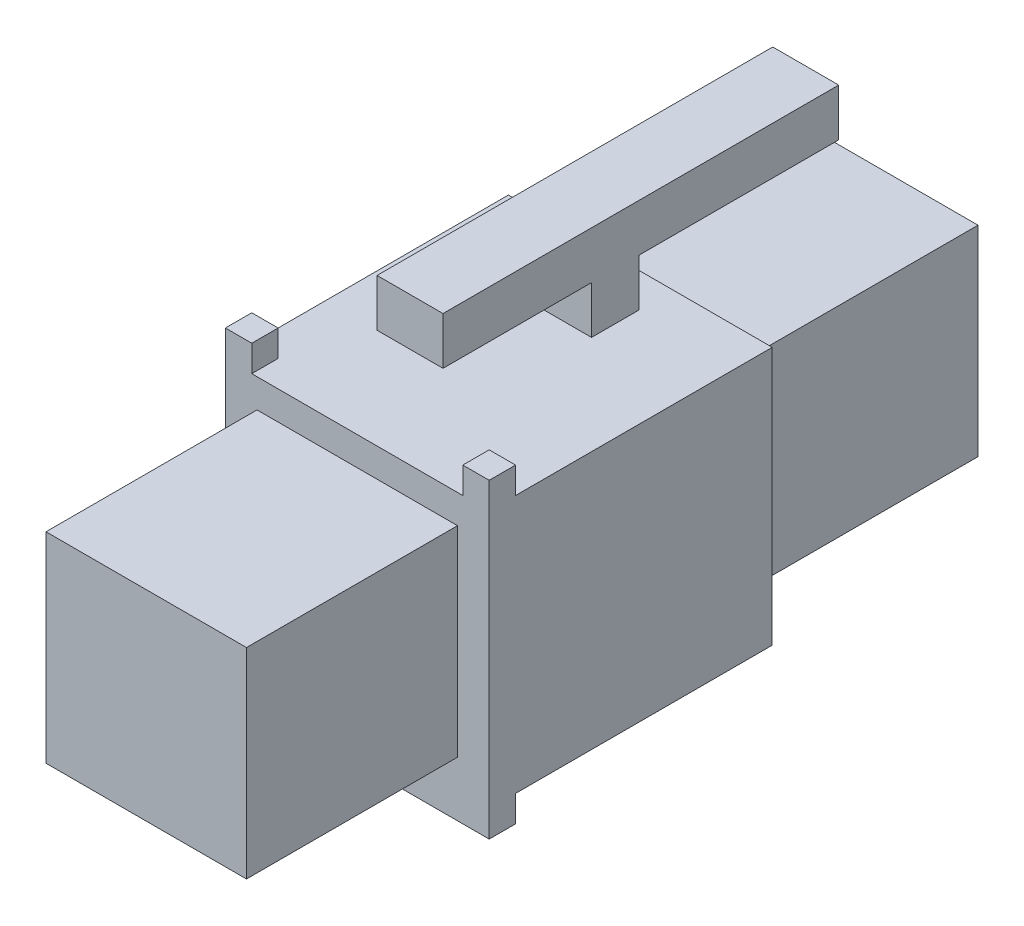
ISO-10303-21;
HEADER;
FILE_DESCRIPTION(('STEP AP214'),'2;1');
FILE_NAME('part.step','',(''),(''),'','','');
FILE_SCHEMA(('AUTOMOTIVE_DESIGN { 1 0 10303 214 1 1 1 1 }'));
ENDSEC;
DATA;
#1=APPLICATION_CONTEXT('core data for automotive mechanical design processes');
#2=APPLICATION_PROTOCOL_DEFINITION('international standard','automotive_design',2000,#1);
#3=PRODUCT_CONTEXT('',#1,'mechanical');
#4=PRODUCT('Part','Part','',(#3));
#5=PRODUCT_RELATED_PRODUCT_CATEGORY('part','',(#4));
#6=PRODUCT_DEFINITION_FORMATION('','',#4);
#7=PRODUCT_DEFINITION_CONTEXT('part definition',#1,'design');
#8=PRODUCT_DEFINITION('design','',#6,#7);
#9=PRODUCT_DEFINITION_SHAPE('','',#8);
#10=(LENGTH_UNIT() NAMED_UNIT(*) SI_UNIT(.MILLI.,.METRE.));
#11=(NAMED_UNIT(*) PLANE_ANGLE_UNIT() SI_UNIT($,.RADIAN.));
#12=(NAMED_UNIT(*) SI_UNIT($,.STERADIAN.) SOLID_ANGLE_UNIT());
#13=UNCERTAINTY_MEASURE_WITH_UNIT(LENGTH_MEASURE(1.E-05),#10,'distance_accuracy_value','');
#14=(GEOMETRIC_REPRESENTATION_CONTEXT(3) GLOBAL_UNCERTAINTY_ASSIGNED_CONTEXT((#13)) GLOBAL_UNIT_ASSIGNED_CONTEXT((#10,
#11,#12)) REPRESENTATION_CONTEXT('',''));
#15=CARTESIAN_POINT('',(0.,0.,0.));
#16=DIRECTION('',(0.,0.,1.));
#17=DIRECTION('',(1.,0.,0.));
#18=AXIS2_PLACEMENT_3D('',#15,#16,#17);
#19=CARTESIAN_POINT('',(5.,4.89,10.73));
#20=DIRECTION('',(0.,0.,-1.));
#21=DIRECTION('',(0.,1.,0.));
#22=AXIS2_PLACEMENT_3D('',#19,#20,#21);
#23=PLANE('',#22);
#24=DIRECTION('',(0.,-1.,0.));
#25=VECTOR('',#24,1.);
#26=CARTESIAN_POINT('',(-4.,8.49,10.73));
#27=LINE('',#26,#25);
#28=CARTESIAN_POINT('',(-4.,5.89,10.73));
#29=VERTEX_POINT('',#28);
#30=CARTESIAN_POINT('',(-4.,4.89,10.73));
#31=VERTEX_POINT('',#30);
#32=EDGE_CURVE('E253',#29,#31,#27,.T.);
#33=ORIENTED_EDGE('',*,*,#32,.F.);
#34=DIRECTION('',(1.,0.,0.));
#35=VECTOR('',#34,1.);
#36=CARTESIAN_POINT('',(-6.4142135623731,5.89,10.73));
#37=LINE('',#36,#35);
#38=CARTESIAN_POINT('',(-5.,5.89,10.73));
#39=VERTEX_POINT('',#38);
#40=EDGE_CURVE('E402',#39,#29,#37,.T.);
#41=ORIENTED_EDGE('',*,*,#40,.F.);
#42=DIRECTION('',(0.,-1.,0.));
#43=VECTOR('',#42,1.);
#44=CARTESIAN_POINT('',(-5.,4.89,10.73));
#45=LINE('',#44,#43);
#46=CARTESIAN_POINT('',(-5.,-5.89,10.73));
#47=VERTEX_POINT('',#46);
#48=EDGE_CURVE('E406',#39,#47,#45,.T.);
#49=ORIENTED_EDGE('',*,*,#48,.T.);
#50=DIRECTION('',(1.,0.,0.));
#51=VECTOR('',#50,1.);
#52=CARTESIAN_POINT('',(-6.4142135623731,-5.89,10.73));
#53=LINE('',#52,#51);
#54=CARTESIAN_POINT('',(5.,-5.89,10.73));
#55=VERTEX_POINT('',#54);
#56=EDGE_CURVE('E373',#47,#55,#53,.T.);
#57=ORIENTED_EDGE('',*,*,#56,.T.);
#58=DIRECTION('',(0.,-1.,0.));
#59=VECTOR('',#58,1.);
#60=CARTESIAN_POINT('',(5.,4.89,10.73));
#61=LINE('',#60,#59);
#62=CARTESIAN_POINT('',(5.,5.89,10.73));
#63=VERTEX_POINT('',#62);
#64=EDGE_CURVE('E427',#63,#55,#61,.T.);
#65=ORIENTED_EDGE('',*,*,#64,.F.);
#66=CARTESIAN_POINT('',(4.,5.89,10.73));
#67=VERTEX_POINT('',#66);
#68=EDGE_CURVE('E463',#67,#63,#37,.T.);
#69=ORIENTED_EDGE('',*,*,#68,.F.);
#70=DIRECTION('',(0.,-1.,0.));
#71=VECTOR('',#70,1.);
#72=CARTESIAN_POINT('',(4.,8.49,10.73));
#73=LINE('',#72,#71);
#74=CARTESIAN_POINT('',(4.,4.89,10.73));
#75=VERTEX_POINT('',#74);
#76=EDGE_CURVE('E250',#67,#75,#73,.T.);
#77=ORIENTED_EDGE('',*,*,#76,.T.);
#78=DIRECTION('',(1.,0.,0.));
#79=VECTOR('',#78,1.);
#80=CARTESIAN_POINT('',(-4.,4.89,10.73));
#81=LINE('',#80,#79);
#82=EDGE_CURVE('E241',#31,#75,#81,.T.);
#83=ORIENTED_EDGE('',*,*,#82,.F.);
#84=EDGE_LOOP('',(#33,#41,#49,#57,#65,#69,#77,#83));
#85=FACE_BOUND('',#84,.T.);
#86=DIRECTION('',(0.,-1.,0.));
#87=VECTOR('',#86,1.);
#88=CARTESIAN_POINT('',(-3.8,3.8,10.73));
#89=LINE('',#88,#87);
#90=CARTESIAN_POINT('',(-3.8,3.8,10.73));
#91=VERTEX_POINT('',#90);
#92=CARTESIAN_POINT('',(-3.8,-3.8,10.73));
#93=VERTEX_POINT('',#92);
#94=EDGE_CURVE('E237',#91,#93,#89,.T.);
#95=ORIENTED_EDGE('',*,*,#94,.F.);
#96=DIRECTION('',(-1.,0.,0.));
#97=VECTOR('',#96,1.);
#98=CARTESIAN_POINT('',(3.8,3.8,10.73));
#99=LINE('',#98,#97);
#100=CARTESIAN_POINT('',(3.8,3.8,10.73));
#101=VERTEX_POINT('',#100);
#102=EDGE_CURVE('E234',#101,#91,#99,.T.);
#103=ORIENTED_EDGE('',*,*,#102,.F.);
#104=DIRECTION('',(0.,1.,0.));
#105=VECTOR('',#104,1.);
#106=CARTESIAN_POINT('',(3.8,-3.8,10.73));
#107=LINE('',#106,#105);
#108=CARTESIAN_POINT('',(3.8,-3.8,10.73));
#109=VERTEX_POINT('',#108);
#110=EDGE_CURVE('E52',#109,#101,#107,.T.);
#111=ORIENTED_EDGE('',*,*,#110,.F.);
#112=DIRECTION('',(1.,0.,0.));
#113=VECTOR('',#112,1.);
#114=CARTESIAN_POINT('',(-3.8,-3.8,10.73));
#115=LINE('',#114,#113);
#116=EDGE_CURVE('E47',#93,#109,#115,.T.);
#117=ORIENTED_EDGE('',*,*,#116,.F.);
#118=EDGE_LOOP('',(#95,#103,#111,#117));
#119=FACE_BOUND('',#118,.T.);
#120=ADVANCED_FACE('F32',(#85,#119),#23,.F.);
#121=CARTESIAN_POINT('',(-6.4142135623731,5.89,10.73));
#122=DIRECTION('',(0.,1.,0.));
#123=DIRECTION('',(0.,0.,1.));
#124=AXIS2_PLACEMENT_3D('',#121,#122,#123);
#125=PLANE('',#124);
#126=ORIENTED_EDGE('',*,*,#40,.T.);
#127=DIRECTION('',(0.,0.,-1.));
#128=VECTOR('',#127,1.);
#129=CARTESIAN_POINT('',(-4.,5.89,10.73));
#130=LINE('',#129,#128);
#131=CARTESIAN_POINT('',(-4.,5.89,9.73));
#132=VERTEX_POINT('',#131);
#133=EDGE_CURVE('E258',#29,#132,#130,.T.);
#134=ORIENTED_EDGE('',*,*,#133,.T.);
#135=DIRECTION('',(1.,0.,0.));
#136=VECTOR('',#135,1.);
#137=CARTESIAN_POINT('',(-6.4142135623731,5.89,9.73));
#138=LINE('',#137,#136);
#139=CARTESIAN_POINT('',(-5.,5.89,9.73));
#140=VERTEX_POINT('',#139);
#141=EDGE_CURVE('E387',#140,#132,#138,.T.);
#142=ORIENTED_EDGE('',*,*,#141,.F.);
#143=DIRECTION('',(0.,0.,-1.));
#144=VECTOR('',#143,1.);
#145=CARTESIAN_POINT('',(-5.,5.89,10.73));
#146=LINE('',#145,#144);
#147=EDGE_CURVE('E401',#39,#140,#146,.T.);
#148=ORIENTED_EDGE('',*,*,#147,.F.);
#149=EDGE_LOOP('',(#126,#134,#142,#148));
#150=FACE_BOUND('',#149,.T.);
#151=ADVANCED_FACE('F475',(#150),#125,.T.);
#152=CARTESIAN_POINT('',(4.,5.89,9.73));
#153=VERTEX_POINT('',#152);
#154=CARTESIAN_POINT('',(5.,5.89,9.73));
#155=VERTEX_POINT('',#154);
#156=EDGE_CURVE('E396',#153,#155,#138,.T.);
#157=ORIENTED_EDGE('',*,*,#156,.F.);
#158=DIRECTION('',(0.,0.,1.));
#159=VECTOR('',#158,1.);
#160=CARTESIAN_POINT('',(4.,5.89,10.73));
#161=LINE('',#160,#159);
#162=EDGE_CURVE('E255',#153,#67,#161,.T.);
#163=ORIENTED_EDGE('',*,*,#162,.T.);
#164=ORIENTED_EDGE('',*,*,#68,.T.);
#165=DIRECTION('',(0.,0.,1.));
#166=VECTOR('',#165,1.);
#167=CARTESIAN_POINT('',(5.,5.89,10.73));
#168=LINE('',#167,#166);
#169=EDGE_CURVE('E383',#155,#63,#168,.T.);
#170=ORIENTED_EDGE('',*,*,#169,.F.);
#171=EDGE_LOOP('',(#157,#163,#164,#170));
#172=FACE_BOUND('',#171,.T.);
#173=ADVANCED_FACE('F483',(#172),#125,.T.);
#174=CARTESIAN_POINT('',(-6.4142135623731,4.89,9.73));
#175=DIRECTION('',(0.,0.,-1.));
#176=DIRECTION('',(-1.,0.,0.));
#177=AXIS2_PLACEMENT_3D('',#174,#175,#176);
#178=PLANE('',#177);
#179=ORIENTED_EDGE('',*,*,#141,.T.);
#180=DIRECTION('',(0.,-1.,0.));
#181=VECTOR('',#180,1.);
#182=CARTESIAN_POINT('',(-4.,4.89,9.73));
#183=LINE('',#182,#181);
#184=CARTESIAN_POINT('',(-4.,4.89,9.73));
#185=VERTEX_POINT('',#184);
#186=EDGE_CURVE('E11',#132,#185,#183,.T.);
#187=ORIENTED_EDGE('',*,*,#186,.T.);
#188=DIRECTION('',(1.,0.,0.));
#189=VECTOR('',#188,1.);
#190=CARTESIAN_POINT('',(-6.4142135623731,4.89,9.73));
#191=LINE('',#190,#189);
#192=CARTESIAN_POINT('',(-5.,4.89,9.73));
#193=VERTEX_POINT('',#192);
#194=EDGE_CURVE('E382',#193,#185,#191,.T.);
#195=ORIENTED_EDGE('',*,*,#194,.F.);
#196=DIRECTION('',(0.,-1.,0.));
#197=VECTOR('',#196,1.);
#198=CARTESIAN_POINT('',(-5.,4.89,9.73));
#199=LINE('',#198,#197);
#200=EDGE_CURVE('E399',#140,#193,#199,.T.);
#201=ORIENTED_EDGE('',*,*,#200,.F.);
#202=EDGE_LOOP('',(#179,#187,#195,#201));
#203=FACE_BOUND('',#202,.T.);
#204=ADVANCED_FACE('F473',(#203),#178,.T.);
#205=CARTESIAN_POINT('',(4.,4.89,9.73));
#206=VERTEX_POINT('',#205);
#207=CARTESIAN_POINT('',(5.,4.89,9.73));
#208=VERTEX_POINT('',#207);
#209=EDGE_CURVE('E380',#206,#208,#191,.T.);
#210=ORIENTED_EDGE('',*,*,#209,.F.);
#211=DIRECTION('',(0.,1.,0.));
#212=VECTOR('',#211,1.);
#213=CARTESIAN_POINT('',(4.,4.89,9.73));
#214=LINE('',#213,#212);
#215=EDGE_CURVE('E40',#206,#153,#214,.T.);
#216=ORIENTED_EDGE('',*,*,#215,.T.);
#217=ORIENTED_EDGE('',*,*,#156,.T.);
#218=DIRECTION('',(0.,1.,0.));
#219=VECTOR('',#218,1.);
#220=CARTESIAN_POINT('',(5.,4.89,9.73));
#221=LINE('',#220,#219);
#222=EDGE_CURVE('E451',#208,#155,#221,.T.);
#223=ORIENTED_EDGE('',*,*,#222,.F.);
#224=EDGE_LOOP('',(#210,#216,#217,#223));
#225=FACE_BOUND('',#224,.T.);
#226=ADVANCED_FACE('F452',(#225),#178,.T.);
#227=CARTESIAN_POINT('',(5.,4.89,0.));
#228=DIRECTION('',(0.,0.,1.));
#229=DIRECTION('',(1.,0.,0.));
#230=AXIS2_PLACEMENT_3D('',#227,#228,#229);
#231=PLANE('',#230);
#232=DIRECTION('',(0.,1.,0.));
#233=VECTOR('',#232,1.);
#234=CARTESIAN_POINT('',(-5.,4.89,0.));
#235=LINE('',#234,#233);
#236=CARTESIAN_POINT('',(-5.,-4.89,0.));
#237=VERTEX_POINT('',#236);
#238=CARTESIAN_POINT('',(-5.,4.89,0.));
#239=VERTEX_POINT('',#238);
#240=EDGE_CURVE('E420',#237,#239,#235,.T.);
#241=ORIENTED_EDGE('',*,*,#240,.T.);
#242=DIRECTION('',(-1.,0.,0.));
#243=VECTOR('',#242,1.);
#244=CARTESIAN_POINT('',(5.,4.89,0.));
#245=LINE('',#244,#243);
#246=CARTESIAN_POINT('',(5.,4.89,0.));
#247=VERTEX_POINT('',#246);
#248=EDGE_CURVE('E414',#247,#239,#245,.T.);
#249=ORIENTED_EDGE('',*,*,#248,.F.);
#250=DIRECTION('',(0.,1.,0.));
#251=VECTOR('',#250,1.);
#252=CARTESIAN_POINT('',(5.,4.89,0.));
#253=LINE('',#252,#251);
#254=CARTESIAN_POINT('',(5.,-4.89,0.));
#255=VERTEX_POINT('',#254);
#256=EDGE_CURVE('E389',#255,#247,#253,.T.);
#257=ORIENTED_EDGE('',*,*,#256,.F.);
#258=DIRECTION('',(-1.,0.,0.));
#259=VECTOR('',#258,1.);
#260=CARTESIAN_POINT('',(5.,-4.89,0.));
#261=LINE('',#260,#259);
#262=EDGE_CURVE('E411',#255,#237,#261,.T.);
#263=ORIENTED_EDGE('',*,*,#262,.T.);
#264=EDGE_LOOP('',(#241,#249,#257,#263));
#265=FACE_BOUND('',#264,.T.);
#266=DIRECTION('',(1.,0.,0.));
#267=VECTOR('',#266,1.);
#268=CARTESIAN_POINT('',(-3.8,3.8,0.));
#269=LINE('',#268,#267);
#270=CARTESIAN_POINT('',(-3.8,3.8,0.));
#271=VERTEX_POINT('',#270);
#272=CARTESIAN_POINT('',(3.8,3.8,0.));
#273=VERTEX_POINT('',#272);
#274=EDGE_CURVE('E321',#271,#273,#269,.T.);
#275=ORIENTED_EDGE('',*,*,#274,.F.);
#276=DIRECTION('',(0.,1.,0.));
#277=VECTOR('',#276,1.);
#278=CARTESIAN_POINT('',(-3.8,3.8,0.));
#279=LINE('',#278,#277);
#280=CARTESIAN_POINT('',(-3.8,-3.8,0.));
#281=VERTEX_POINT('',#280);
#282=EDGE_CURVE('E326',#281,#271,#279,.T.);
#283=ORIENTED_EDGE('',*,*,#282,.F.);
#284=DIRECTION('',(-1.,0.,0.));
#285=VECTOR('',#284,1.);
#286=CARTESIAN_POINT('',(-3.8,-3.8,0.));
#287=LINE('',#286,#285);
#288=CARTESIAN_POINT('',(3.8,-3.8,0.));
#289=VERTEX_POINT('',#288);
#290=EDGE_CURVE('E338',#289,#281,#287,.T.);
#291=ORIENTED_EDGE('',*,*,#290,.F.);
#292=DIRECTION('',(0.,-1.,0.));
#293=VECTOR('',#292,1.);
#294=CARTESIAN_POINT('',(3.8,3.8,0.));
#295=LINE('',#294,#293);
#296=EDGE_CURVE('E335',#273,#289,#295,.T.);
#297=ORIENTED_EDGE('',*,*,#296,.F.);
#298=EDGE_LOOP('',(#275,#283,#291,#297));
#299=FACE_BOUND('',#298,.T.);
#300=ADVANCED_FACE('F34',(#265,#299),#231,.F.);
#301=CARTESIAN_POINT('',(5.,-4.89,10.73));
#302=DIRECTION('',(0.,1.,0.));
#303=DIRECTION('',(0.,0.,1.));
#304=AXIS2_PLACEMENT_3D('',#301,#302,#303);
#305=PLANE('',#304);
#306=DIRECTION('',(1.,0.,0.));
#307=VECTOR('',#306,1.);
#308=CARTESIAN_POINT('',(-6.4142135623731,-4.89,9.73));
#309=LINE('',#308,#307);
#310=CARTESIAN_POINT('',(-5.,-4.89,9.73));
#311=VERTEX_POINT('',#310);
#312=CARTESIAN_POINT('',(5.,-4.89,9.73));
#313=VERTEX_POINT('',#312);
#314=EDGE_CURVE('E363',#311,#313,#309,.T.);
#315=ORIENTED_EDGE('',*,*,#314,.F.);
#316=DIRECTION('',(0.,0.,-1.));
#317=VECTOR('',#316,1.);
#318=CARTESIAN_POINT('',(-5.,-4.89,10.73));
#319=LINE('',#318,#317);
#320=EDGE_CURVE('E404',#311,#237,#319,.T.);
#321=ORIENTED_EDGE('',*,*,#320,.T.);
#322=ORIENTED_EDGE('',*,*,#262,.F.);
#323=DIRECTION('',(0.,0.,-1.));
#324=VECTOR('',#323,1.);
#325=CARTESIAN_POINT('',(5.,-4.89,10.73));
#326=LINE('',#325,#324);
#327=EDGE_CURVE('E368',#313,#255,#326,.T.);
#328=ORIENTED_EDGE('',*,*,#327,.F.);
#329=EDGE_LOOP('',(#315,#321,#322,#328));
#330=FACE_BOUND('',#329,.T.);
#331=ADVANCED_FACE('F494',(#330),#305,.F.);
#332=CARTESIAN_POINT('',(5.,4.89,10.73));
#333=DIRECTION('',(0.,-1.,0.));
#334=DIRECTION('',(0.,0.,-1.));
#335=AXIS2_PLACEMENT_3D('',#332,#333,#334);
#336=PLANE('',#335);
#337=DIRECTION('',(-1.,0.,0.));
#338=VECTOR('',#337,1.);
#339=CARTESIAN_POINT('',(1.25,4.89,1.3));
#340=LINE('',#339,#338);
#341=CARTESIAN_POINT('',(1.25,4.89,1.3));
#342=VERTEX_POINT('',#341);
#343=CARTESIAN_POINT('',(-1.25,4.89,1.3));
#344=VERTEX_POINT('',#343);
#345=EDGE_CURVE('E310',#342,#344,#340,.T.);
#346=ORIENTED_EDGE('',*,*,#345,.F.);
#347=DIRECTION('',(0.,0.,-1.));
#348=VECTOR('',#347,1.);
#349=CARTESIAN_POINT('',(1.25,4.89,3.1));
#350=LINE('',#349,#348);
#351=CARTESIAN_POINT('',(1.25,4.89,3.1));
#352=VERTEX_POINT('',#351);
#353=EDGE_CURVE('E271',#352,#342,#350,.T.);
#354=ORIENTED_EDGE('',*,*,#353,.F.);
#355=DIRECTION('',(-1.,0.,0.));
#356=VECTOR('',#355,1.);
#357=CARTESIAN_POINT('',(1.25,4.89,3.1));
#358=LINE('',#357,#356);
#359=CARTESIAN_POINT('',(-1.25,4.89,3.1));
#360=VERTEX_POINT('',#359);
#361=EDGE_CURVE('E313',#352,#360,#358,.T.);
#362=ORIENTED_EDGE('',*,*,#361,.T.);
#363=DIRECTION('',(0.,0.,-1.));
#364=VECTOR('',#363,1.);
#365=CARTESIAN_POINT('',(-1.25,4.89,3.1));
#366=LINE('',#365,#364);
#367=EDGE_CURVE('E290',#360,#344,#366,.T.);
#368=ORIENTED_EDGE('',*,*,#367,.T.);
#369=EDGE_LOOP('',(#346,#354,#362,#368));
#370=FACE_BOUND('',#369,.T.);
#371=DIRECTION('',(0.,0.,1.));
#372=VECTOR('',#371,1.);
#373=CARTESIAN_POINT('',(-5.,4.89,10.73));
#374=LINE('',#373,#372);
#375=EDGE_CURVE('E417',#239,#193,#374,.T.);
#376=ORIENTED_EDGE('',*,*,#375,.T.);
#377=ORIENTED_EDGE('',*,*,#194,.T.);
#378=DIRECTION('',(0.,0.,1.));
#379=VECTOR('',#378,1.);
#380=CARTESIAN_POINT('',(-4.,4.89,9.73));
#381=LINE('',#380,#379);
#382=EDGE_CURVE('E238',#185,#31,#381,.T.);
#383=ORIENTED_EDGE('',*,*,#382,.T.);
#384=ORIENTED_EDGE('',*,*,#82,.T.);
#385=DIRECTION('',(0.,0.,-1.));
#386=VECTOR('',#385,1.);
#387=CARTESIAN_POINT('',(4.,4.89,9.73));
#388=LINE('',#387,#386);
#389=EDGE_CURVE('E248',#75,#206,#388,.T.);
#390=ORIENTED_EDGE('',*,*,#389,.T.);
#391=ORIENTED_EDGE('',*,*,#209,.T.);
#392=DIRECTION('',(0.,0.,1.));
#393=VECTOR('',#392,1.);
#394=CARTESIAN_POINT('',(5.,4.89,10.73));
#395=LINE('',#394,#393);
#396=EDGE_CURVE('E421',#247,#208,#395,.T.);
#397=ORIENTED_EDGE('',*,*,#396,.F.);
#398=ORIENTED_EDGE('',*,*,#248,.T.);
#399=EDGE_LOOP('',(#376,#377,#383,#384,#390,#391,#397,#398));
#400=FACE_BOUND('',#399,.T.);
#401=ADVANCED_FACE('F444',(#370,#400),#336,.F.);
#402=CARTESIAN_POINT('',(5.,-4.89,0.));
#403=DIRECTION('',(1.,0.,0.));
#404=DIRECTION('',(0.,0.,-1.));
#405=AXIS2_PLACEMENT_3D('',#402,#403,#404);
#406=PLANE('',#405);
#407=ORIENTED_EDGE('',*,*,#256,.T.);
#408=ORIENTED_EDGE('',*,*,#396,.T.);
#409=ORIENTED_EDGE('',*,*,#222,.T.);
#410=ORIENTED_EDGE('',*,*,#169,.T.);
#411=ORIENTED_EDGE('',*,*,#64,.T.);
#412=DIRECTION('',(0.,0.,-1.));
#413=VECTOR('',#412,1.);
#414=CARTESIAN_POINT('',(5.,-5.89,10.73));
#415=LINE('',#414,#413);
#416=CARTESIAN_POINT('',(5.,-5.89,9.73));
#417=VERTEX_POINT('',#416);
#418=EDGE_CURVE('E354',#55,#417,#415,.T.);
#419=ORIENTED_EDGE('',*,*,#418,.T.);
#420=DIRECTION('',(0.,1.,0.));
#421=VECTOR('',#420,1.);
#422=CARTESIAN_POINT('',(5.,-4.89,9.73));
#423=LINE('',#422,#421);
#424=EDGE_CURVE('E357',#417,#313,#423,.T.);
#425=ORIENTED_EDGE('',*,*,#424,.T.);
#426=ORIENTED_EDGE('',*,*,#327,.T.);
#427=EDGE_LOOP('',(#407,#408,#409,#410,#411,#419,#425,#426));
#428=FACE_BOUND('',#427,.T.);
#429=ADVANCED_FACE('F438',(#428),#406,.T.);
#430=CARTESIAN_POINT('',(-5.,-4.89,0.));
#431=DIRECTION('',(1.,0.,0.));
#432=DIRECTION('',(0.,0.,-1.));
#433=AXIS2_PLACEMENT_3D('',#430,#431,#432);
#434=PLANE('',#433);
#435=ORIENTED_EDGE('',*,*,#240,.F.);
#436=ORIENTED_EDGE('',*,*,#320,.F.);
#437=DIRECTION('',(0.,-1.,0.));
#438=VECTOR('',#437,1.);
#439=CARTESIAN_POINT('',(-5.,-4.89,9.73));
#440=LINE('',#439,#438);
#441=CARTESIAN_POINT('',(-5.,-5.89,9.73));
#442=VERTEX_POINT('',#441);
#443=EDGE_CURVE('E367',#311,#442,#440,.T.);
#444=ORIENTED_EDGE('',*,*,#443,.T.);
#445=DIRECTION('',(0.,0.,1.));
#446=VECTOR('',#445,1.);
#447=CARTESIAN_POINT('',(-5.,-5.89,10.73));
#448=LINE('',#447,#446);
#449=EDGE_CURVE('E377',#442,#47,#448,.T.);
#450=ORIENTED_EDGE('',*,*,#449,.T.);
#451=ORIENTED_EDGE('',*,*,#48,.F.);
#452=ORIENTED_EDGE('',*,*,#147,.T.);
#453=ORIENTED_EDGE('',*,*,#200,.T.);
#454=ORIENTED_EDGE('',*,*,#375,.F.);
#455=EDGE_LOOP('',(#435,#436,#444,#450,#451,#452,#453,#454));
#456=FACE_BOUND('',#455,.T.);
#457=ADVANCED_FACE('F495',(#456),#434,.F.);
#458=CARTESIAN_POINT('',(-6.4142135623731,-4.89,9.73));
#459=DIRECTION('',(0.,0.,-1.));
#460=DIRECTION('',(0.,1.,0.));
#461=AXIS2_PLACEMENT_3D('',#458,#459,#460);
#462=PLANE('',#461);
#463=ORIENTED_EDGE('',*,*,#443,.F.);
#464=ORIENTED_EDGE('',*,*,#314,.T.);
#465=ORIENTED_EDGE('',*,*,#424,.F.);
#466=DIRECTION('',(1.,0.,0.));
#467=VECTOR('',#466,1.);
#468=CARTESIAN_POINT('',(-6.4142135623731,-5.89,9.73));
#469=LINE('',#468,#467);
#470=EDGE_CURVE('E360',#442,#417,#469,.T.);
#471=ORIENTED_EDGE('',*,*,#470,.F.);
#472=EDGE_LOOP('',(#463,#464,#465,#471));
#473=FACE_BOUND('',#472,.T.);
#474=ADVANCED_FACE('F491',(#473),#462,.T.);
#475=CARTESIAN_POINT('',(-6.4142135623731,-5.89,10.73));
#476=DIRECTION('',(0.,-1.,0.));
#477=DIRECTION('',(0.,0.,-1.));
#478=AXIS2_PLACEMENT_3D('',#475,#476,#477);
#479=PLANE('',#478);
#480=ORIENTED_EDGE('',*,*,#449,.F.);
#481=ORIENTED_EDGE('',*,*,#470,.T.);
#482=ORIENTED_EDGE('',*,*,#418,.F.);
#483=ORIENTED_EDGE('',*,*,#56,.F.);
#484=EDGE_LOOP('',(#480,#481,#482,#483));
#485=FACE_BOUND('',#484,.T.);
#486=ADVANCED_FACE('F486',(#485),#479,.T.);
#487=CARTESIAN_POINT('',(-3.8,3.8,-9.));
#488=DIRECTION('',(0.,-1.,0.));
#489=DIRECTION('',(1.,0.,0.));
#490=AXIS2_PLACEMENT_3D('',#487,#488,#489);
#491=PLANE('',#490);
#492=ORIENTED_EDGE('',*,*,#274,.T.);
#493=DIRECTION('',(0.,0.,1.));
#494=VECTOR('',#493,1.);
#495=CARTESIAN_POINT('',(3.8,3.8,-9.));
#496=LINE('',#495,#494);
#497=CARTESIAN_POINT('',(3.8,3.8,-9.));
#498=VERTEX_POINT('',#497);
#499=EDGE_CURVE('E351',#498,#273,#496,.T.);
#500=ORIENTED_EDGE('',*,*,#499,.F.);
#501=DIRECTION('',(1.,0.,0.));
#502=VECTOR('',#501,1.);
#503=CARTESIAN_POINT('',(-3.8,3.8,-9.));
#504=LINE('',#503,#502);
#505=CARTESIAN_POINT('',(-3.8,3.8,-9.));
#506=VERTEX_POINT('',#505);
#507=EDGE_CURVE('E322',#506,#498,#504,.T.);
#508=ORIENTED_EDGE('',*,*,#507,.F.);
#509=DIRECTION('',(0.,0.,1.));
#510=VECTOR('',#509,1.);
#511=CARTESIAN_POINT('',(-3.8,3.8,-9.));
#512=LINE('',#511,#510);
#513=EDGE_CURVE('E332',#506,#271,#512,.T.);
#514=ORIENTED_EDGE('',*,*,#513,.T.);
#515=EDGE_LOOP('',(#492,#500,#508,#514));
#516=FACE_BOUND('',#515,.T.);
#517=ADVANCED_FACE('F592',(#516),#491,.F.);
#518=CARTESIAN_POINT('',(3.8,3.8,-9.));
#519=DIRECTION('',(-1.,0.,0.));
#520=DIRECTION('',(0.,-1.,0.));
#521=AXIS2_PLACEMENT_3D('',#518,#519,#520);
#522=PLANE('',#521);
#523=ORIENTED_EDGE('',*,*,#296,.T.);
#524=DIRECTION('',(0.,0.,1.));
#525=VECTOR('',#524,1.);
#526=CARTESIAN_POINT('',(3.8,-3.8,-9.));
#527=LINE('',#526,#525);
#528=CARTESIAN_POINT('',(3.8,-3.8,-9.));
#529=VERTEX_POINT('',#528);
#530=EDGE_CURVE('E348',#529,#289,#527,.T.);
#531=ORIENTED_EDGE('',*,*,#530,.F.);
#532=DIRECTION('',(0.,-1.,0.));
#533=VECTOR('',#532,1.);
#534=CARTESIAN_POINT('',(3.8,3.8,-9.));
#535=LINE('',#534,#533);
#536=EDGE_CURVE('E325',#498,#529,#535,.T.);
#537=ORIENTED_EDGE('',*,*,#536,.F.);
#538=ORIENTED_EDGE('',*,*,#499,.T.);
#539=EDGE_LOOP('',(#523,#531,#537,#538));
#540=FACE_BOUND('',#539,.T.);
#541=ADVANCED_FACE('F588',(#540),#522,.F.);
#542=CARTESIAN_POINT('',(-3.8,-3.8,-9.));
#543=DIRECTION('',(0.,1.,0.));
#544=DIRECTION('',(-1.,0.,0.));
#545=AXIS2_PLACEMENT_3D('',#542,#543,#544);
#546=PLANE('',#545);
#547=ORIENTED_EDGE('',*,*,#290,.T.);
#548=DIRECTION('',(0.,0.,1.));
#549=VECTOR('',#548,1.);
#550=CARTESIAN_POINT('',(-3.8,-3.8,-9.));
#551=LINE('',#550,#549);
#552=CARTESIAN_POINT('',(-3.8,-3.8,-9.));
#553=VERTEX_POINT('',#552);
#554=EDGE_CURVE('E345',#553,#281,#551,.T.);
#555=ORIENTED_EDGE('',*,*,#554,.F.);
#556=DIRECTION('',(-1.,0.,0.));
#557=VECTOR('',#556,1.);
#558=CARTESIAN_POINT('',(-3.8,-3.8,-9.));
#559=LINE('',#558,#557);
#560=EDGE_CURVE('E328',#529,#553,#559,.T.);
#561=ORIENTED_EDGE('',*,*,#560,.F.);
#562=ORIENTED_EDGE('',*,*,#530,.T.);
#563=EDGE_LOOP('',(#547,#555,#561,#562));
#564=FACE_BOUND('',#563,.T.);
#565=ADVANCED_FACE('F584',(#564),#546,.F.);
#566=CARTESIAN_POINT('',(-3.8,3.8,-9.));
#567=DIRECTION('',(1.,0.,0.));
#568=DIRECTION('',(0.,1.,0.));
#569=AXIS2_PLACEMENT_3D('',#566,#567,#568);
#570=PLANE('',#569);
#571=ORIENTED_EDGE('',*,*,#282,.T.);
#572=ORIENTED_EDGE('',*,*,#513,.F.);
#573=DIRECTION('',(0.,1.,0.));
#574=VECTOR('',#573,1.);
#575=CARTESIAN_POINT('',(-3.8,3.8,-9.));
#576=LINE('',#575,#574);
#577=EDGE_CURVE('E330',#553,#506,#576,.T.);
#578=ORIENTED_EDGE('',*,*,#577,.F.);
#579=ORIENTED_EDGE('',*,*,#554,.T.);
#580=EDGE_LOOP('',(#571,#572,#578,#579));
#581=FACE_BOUND('',#580,.T.);
#582=ADVANCED_FACE('F580',(#581),#570,.F.);
#583=CARTESIAN_POINT('',(3.8,3.8,-9.));
#584=DIRECTION('',(0.,0.,-1.));
#585=DIRECTION('',(-1.,0.,0.));
#586=AXIS2_PLACEMENT_3D('',#583,#584,#585);
#587=PLANE('',#586);
#588=ORIENTED_EDGE('',*,*,#507,.T.);
#589=ORIENTED_EDGE('',*,*,#536,.T.);
#590=ORIENTED_EDGE('',*,*,#560,.T.);
#591=ORIENTED_EDGE('',*,*,#577,.T.);
#592=EDGE_LOOP('',(#588,#589,#590,#591));
#593=FACE_BOUND('',#592,.T.);
#594=ADVANCED_FACE('F577',(#593),#587,.T.);
#595=CARTESIAN_POINT('',(1.25,8.49,8.73));
#596=DIRECTION('',(0.,0.,-1.));
#597=DIRECTION('',(-1.,0.,0.));
#598=AXIS2_PLACEMENT_3D('',#595,#596,#597);
#599=PLANE('',#598);
#600=DIRECTION('',(0.,-1.,0.));
#601=VECTOR('',#600,1.);
#602=CARTESIAN_POINT('',(-1.25,8.49,8.73));
#603=LINE('',#602,#601);
#604=CARTESIAN_POINT('',(-1.25,8.49,8.73));
#605=VERTEX_POINT('',#604);
#606=CARTESIAN_POINT('',(-1.25,6.69,8.73));
#607=VERTEX_POINT('',#606);
#608=EDGE_CURVE('E261',#605,#607,#603,.T.);
#609=ORIENTED_EDGE('',*,*,#608,.T.);
#610=DIRECTION('',(-1.,0.,0.));
#611=VECTOR('',#610,1.);
#612=CARTESIAN_POINT('',(1.25,6.69,8.73));
#613=LINE('',#612,#611);
#614=CARTESIAN_POINT('',(1.25,6.69,8.73));
#615=VERTEX_POINT('',#614);
#616=EDGE_CURVE('E318',#615,#607,#613,.T.);
#617=ORIENTED_EDGE('',*,*,#616,.F.);
#618=DIRECTION('',(0.,-1.,0.));
#619=VECTOR('',#618,1.);
#620=CARTESIAN_POINT('',(1.25,8.49,8.73));
#621=LINE('',#620,#619);
#622=CARTESIAN_POINT('',(1.25,8.49,8.73));
#623=VERTEX_POINT('',#622);
#624=EDGE_CURVE('E262',#623,#615,#621,.T.);
#625=ORIENTED_EDGE('',*,*,#624,.F.);
#626=DIRECTION('',(-1.,0.,0.));
#627=VECTOR('',#626,1.);
#628=CARTESIAN_POINT('',(1.25,8.49,8.73));
#629=LINE('',#628,#627);
#630=EDGE_CURVE('E282',#623,#605,#629,.T.);
#631=ORIENTED_EDGE('',*,*,#630,.T.);
#632=EDGE_LOOP('',(#609,#617,#625,#631));
#633=FACE_BOUND('',#632,.T.);
#634=ADVANCED_FACE('F545',(#633),#599,.F.);
#635=CARTESIAN_POINT('',(1.25,6.69,8.73));
#636=DIRECTION('',(0.,1.,0.));
#637=DIRECTION('',(0.,0.,1.));
#638=AXIS2_PLACEMENT_3D('',#635,#636,#637);
#639=PLANE('',#638);
#640=DIRECTION('',(0.,0.,-1.));
#641=VECTOR('',#640,1.);
#642=CARTESIAN_POINT('',(-1.25,6.69,8.73));
#643=LINE('',#642,#641);
#644=CARTESIAN_POINT('',(-1.25,6.69,3.1));
#645=VERTEX_POINT('',#644);
#646=EDGE_CURVE('E285',#607,#645,#643,.T.);
#647=ORIENTED_EDGE('',*,*,#646,.T.);
#648=DIRECTION('',(-1.,0.,0.));
#649=VECTOR('',#648,1.);
#650=CARTESIAN_POINT('',(1.25,6.69,3.1));
#651=LINE('',#650,#649);
#652=CARTESIAN_POINT('',(1.25,6.69,3.1));
#653=VERTEX_POINT('',#652);
#654=EDGE_CURVE('E315',#653,#645,#651,.T.);
#655=ORIENTED_EDGE('',*,*,#654,.F.);
#656=DIRECTION('',(0.,0.,-1.));
#657=VECTOR('',#656,1.);
#658=CARTESIAN_POINT('',(1.25,6.69,8.73));
#659=LINE('',#658,#657);
#660=EDGE_CURVE('E265',#615,#653,#659,.T.);
#661=ORIENTED_EDGE('',*,*,#660,.F.);
#662=ORIENTED_EDGE('',*,*,#616,.T.);
#663=EDGE_LOOP('',(#647,#655,#661,#662));
#664=FACE_BOUND('',#663,.T.);
#665=ADVANCED_FACE('F548',(#664),#639,.F.);
#666=CARTESIAN_POINT('',(1.25,6.69,3.1));
#667=DIRECTION('',(0.,0.,-1.));
#668=DIRECTION('',(0.,1.,0.));
#669=AXIS2_PLACEMENT_3D('',#666,#667,#668);
#670=PLANE('',#669);
#671=DIRECTION('',(0.,-1.,0.));
#672=VECTOR('',#671,1.);
#673=CARTESIAN_POINT('',(-1.25,6.69,3.1));
#674=LINE('',#673,#672);
#675=EDGE_CURVE('E287',#645,#360,#674,.T.);
#676=ORIENTED_EDGE('',*,*,#675,.T.);
#677=ORIENTED_EDGE('',*,*,#361,.F.);
#678=DIRECTION('',(0.,-1.,0.));
#679=VECTOR('',#678,1.);
#680=CARTESIAN_POINT('',(1.25,6.69,3.1));
#681=LINE('',#680,#679);
#682=EDGE_CURVE('E268',#653,#352,#681,.T.);
#683=ORIENTED_EDGE('',*,*,#682,.F.);
#684=ORIENTED_EDGE('',*,*,#654,.T.);
#685=EDGE_LOOP('',(#676,#677,#683,#684));
#686=FACE_BOUND('',#685,.T.);
#687=ADVANCED_FACE('F551',(#686),#670,.F.);
#688=CARTESIAN_POINT('',(1.25,6.69,1.3));
#689=DIRECTION('',(0.,0.,1.));
#690=DIRECTION('',(0.,-1.,0.));
#691=AXIS2_PLACEMENT_3D('',#688,#689,#690);
#692=PLANE('',#691);
#693=DIRECTION('',(0.,1.,0.));
#694=VECTOR('',#693,1.);
#695=CARTESIAN_POINT('',(-1.25,6.69,1.3));
#696=LINE('',#695,#694);
#697=CARTESIAN_POINT('',(-1.25,6.69,1.3));
#698=VERTEX_POINT('',#697);
#699=EDGE_CURVE('E292',#344,#698,#696,.T.);
#700=ORIENTED_EDGE('',*,*,#699,.T.);
#701=DIRECTION('',(-1.,0.,0.));
#702=VECTOR('',#701,1.);
#703=CARTESIAN_POINT('',(1.25,6.69,1.3));
#704=LINE('',#703,#702);
#705=CARTESIAN_POINT('',(1.25,6.69,1.3));
#706=VERTEX_POINT('',#705);
#707=EDGE_CURVE('E307',#706,#698,#704,.T.);
#708=ORIENTED_EDGE('',*,*,#707,.F.);
#709=DIRECTION('',(0.,1.,0.));
#710=VECTOR('',#709,1.);
#711=CARTESIAN_POINT('',(1.25,6.69,1.3));
#712=LINE('',#711,#710);
#713=EDGE_CURVE('E274',#342,#706,#712,.T.);
#714=ORIENTED_EDGE('',*,*,#713,.F.);
#715=ORIENTED_EDGE('',*,*,#345,.T.);
#716=EDGE_LOOP('',(#700,#708,#714,#715));
#717=FACE_BOUND('',#716,.T.);
#718=ADVANCED_FACE('F525',(#717),#692,.F.);
#719=CARTESIAN_POINT('',(1.25,6.69,1.3));
#720=DIRECTION('',(0.,1.,0.));
#721=DIRECTION('',(0.,0.,1.));
#722=AXIS2_PLACEMENT_3D('',#719,#720,#721);
#723=PLANE('',#722);
#724=DIRECTION('',(0.,0.,-1.));
#725=VECTOR('',#724,1.);
#726=CARTESIAN_POINT('',(-1.25,6.69,1.3));
#727=LINE('',#726,#725);
#728=CARTESIAN_POINT('',(-1.25,6.69,-6.27));
#729=VERTEX_POINT('',#728);
#730=EDGE_CURVE('E294',#698,#729,#727,.T.);
#731=ORIENTED_EDGE('',*,*,#730,.T.);
#732=DIRECTION('',(-1.,0.,0.));
#733=VECTOR('',#732,1.);
#734=CARTESIAN_POINT('',(1.25,6.69,-6.27));
#735=LINE('',#734,#733);
#736=CARTESIAN_POINT('',(1.25,6.69,-6.27));
#737=VERTEX_POINT('',#736);
#738=EDGE_CURVE('E304',#737,#729,#735,.T.);
#739=ORIENTED_EDGE('',*,*,#738,.F.);
#740=DIRECTION('',(0.,0.,-1.));
#741=VECTOR('',#740,1.);
#742=CARTESIAN_POINT('',(1.25,6.69,1.3));
#743=LINE('',#742,#741);
#744=EDGE_CURVE('E276',#706,#737,#743,.T.);
#745=ORIENTED_EDGE('',*,*,#744,.F.);
#746=ORIENTED_EDGE('',*,*,#707,.T.);
#747=EDGE_LOOP('',(#731,#739,#745,#746));
#748=FACE_BOUND('',#747,.T.);
#749=ADVANCED_FACE('F530',(#748),#723,.F.);
#750=CARTESIAN_POINT('',(1.25,8.49,-6.27));
#751=DIRECTION('',(0.,0.,1.));
#752=DIRECTION('',(1.,0.,0.));
#753=AXIS2_PLACEMENT_3D('',#750,#751,#752);
#754=PLANE('',#753);
#755=DIRECTION('',(0.,1.,0.));
#756=VECTOR('',#755,1.);
#757=CARTESIAN_POINT('',(-1.25,8.49,-6.27));
#758=LINE('',#757,#756);
#759=CARTESIAN_POINT('',(-1.25,8.49,-6.27));
#760=VERTEX_POINT('',#759);
#761=EDGE_CURVE('E296',#729,#760,#758,.T.);
#762=ORIENTED_EDGE('',*,*,#761,.T.);
#763=DIRECTION('',(-1.,0.,0.));
#764=VECTOR('',#763,1.);
#765=CARTESIAN_POINT('',(1.25,8.49,-6.27));
#766=LINE('',#765,#764);
#767=CARTESIAN_POINT('',(1.25,8.49,-6.27));
#768=VERTEX_POINT('',#767);
#769=EDGE_CURVE('E301',#768,#760,#766,.T.);
#770=ORIENTED_EDGE('',*,*,#769,.F.);
#771=DIRECTION('',(0.,1.,0.));
#772=VECTOR('',#771,1.);
#773=CARTESIAN_POINT('',(1.25,8.49,-6.27));
#774=LINE('',#773,#772);
#775=EDGE_CURVE('E278',#737,#768,#774,.T.);
#776=ORIENTED_EDGE('',*,*,#775,.F.);
#777=ORIENTED_EDGE('',*,*,#738,.T.);
#778=EDGE_LOOP('',(#762,#770,#776,#777));
#779=FACE_BOUND('',#778,.T.);
#780=ADVANCED_FACE('F536',(#779),#754,.F.);
#781=CARTESIAN_POINT('',(1.25,8.49,8.73));
#782=DIRECTION('',(0.,-1.,0.));
#783=DIRECTION('',(0.,0.,-1.));
#784=AXIS2_PLACEMENT_3D('',#781,#782,#783);
#785=PLANE('',#784);
#786=DIRECTION('',(0.,0.,1.));
#787=VECTOR('',#786,1.);
#788=CARTESIAN_POINT('',(-1.25,8.49,8.73));
#789=LINE('',#788,#787);
#790=EDGE_CURVE('E266',#760,#605,#789,.T.);
#791=ORIENTED_EDGE('',*,*,#790,.T.);
#792=ORIENTED_EDGE('',*,*,#630,.F.);
#793=DIRECTION('',(0.,0.,1.));
#794=VECTOR('',#793,1.);
#795=CARTESIAN_POINT('',(1.25,8.49,8.73));
#796=LINE('',#795,#794);
#797=EDGE_CURVE('E280',#768,#623,#796,.T.);
#798=ORIENTED_EDGE('',*,*,#797,.F.);
#799=ORIENTED_EDGE('',*,*,#769,.T.);
#800=EDGE_LOOP('',(#791,#792,#798,#799));
#801=FACE_BOUND('',#800,.T.);
#802=ADVANCED_FACE('F540',(#801),#785,.F.);
#803=CARTESIAN_POINT('',(1.25,6.69,8.73));
#804=DIRECTION('',(1.,0.,0.));
#805=DIRECTION('',(0.,0.,-1.));
#806=AXIS2_PLACEMENT_3D('',#803,#804,#805);
#807=PLANE('',#806);
#808=ORIENTED_EDGE('',*,*,#624,.T.);
#809=ORIENTED_EDGE('',*,*,#660,.T.);
#810=ORIENTED_EDGE('',*,*,#682,.T.);
#811=ORIENTED_EDGE('',*,*,#353,.T.);
#812=ORIENTED_EDGE('',*,*,#713,.T.);
#813=ORIENTED_EDGE('',*,*,#744,.T.);
#814=ORIENTED_EDGE('',*,*,#775,.T.);
#815=ORIENTED_EDGE('',*,*,#797,.T.);
#816=EDGE_LOOP('',(#808,#809,#810,#811,#812,#813,#814,#815));
#817=FACE_BOUND('',#816,.T.);
#818=ADVANCED_FACE('F521',(#817),#807,.T.);
#819=CARTESIAN_POINT('',(-1.25,6.69,8.73));
#820=DIRECTION('',(1.,0.,0.));
#821=DIRECTION('',(0.,0.,-1.));
#822=AXIS2_PLACEMENT_3D('',#819,#820,#821);
#823=PLANE('',#822);
#824=ORIENTED_EDGE('',*,*,#608,.F.);
#825=ORIENTED_EDGE('',*,*,#790,.F.);
#826=ORIENTED_EDGE('',*,*,#761,.F.);
#827=ORIENTED_EDGE('',*,*,#730,.F.);
#828=ORIENTED_EDGE('',*,*,#699,.F.);
#829=ORIENTED_EDGE('',*,*,#367,.F.);
#830=ORIENTED_EDGE('',*,*,#675,.F.);
#831=ORIENTED_EDGE('',*,*,#646,.F.);
#832=EDGE_LOOP('',(#824,#825,#826,#827,#828,#829,#830,#831));
#833=FACE_BOUND('',#832,.T.);
#834=ADVANCED_FACE('F553',(#833),#823,.F.);
#835=CARTESIAN_POINT('',(-4.,8.49,9.73));
#836=DIRECTION('',(1.,0.,0.));
#837=DIRECTION('',(0.,0.,-1.));
#838=AXIS2_PLACEMENT_3D('',#835,#836,#837);
#839=PLANE('',#838);
#840=ORIENTED_EDGE('',*,*,#32,.T.);
#841=ORIENTED_EDGE('',*,*,#382,.F.);
#842=ORIENTED_EDGE('',*,*,#186,.F.);
#843=ORIENTED_EDGE('',*,*,#133,.F.);
#844=EDGE_LOOP('',(#840,#841,#842,#843));
#845=FACE_BOUND('',#844,.T.);
#846=ADVANCED_FACE('F478',(#845),#839,.T.);
#847=CARTESIAN_POINT('',(4.,8.49,9.73));
#848=DIRECTION('',(-1.,0.,0.));
#849=DIRECTION('',(0.,0.,1.));
#850=AXIS2_PLACEMENT_3D('',#847,#848,#849);
#851=PLANE('',#850);
#852=ORIENTED_EDGE('',*,*,#215,.F.);
#853=ORIENTED_EDGE('',*,*,#389,.F.);
#854=ORIENTED_EDGE('',*,*,#76,.F.);
#855=ORIENTED_EDGE('',*,*,#162,.F.);
#856=EDGE_LOOP('',(#852,#853,#854,#855));
#857=FACE_BOUND('',#856,.T.);
#858=ADVANCED_FACE('F482',(#857),#851,.T.);
#859=CARTESIAN_POINT('',(-3.8,3.8,18.73));
#860=DIRECTION('',(1.,0.,0.));
#861=DIRECTION('',(0.,1.,0.));
#862=AXIS2_PLACEMENT_3D('',#859,#860,#861);
#863=PLANE('',#862);
#864=ORIENTED_EDGE('',*,*,#94,.T.);
#865=DIRECTION('',(0.,0.,-1.));
#866=VECTOR('',#865,1.);
#867=CARTESIAN_POINT('',(-3.8,-3.8,18.73));
#868=LINE('',#867,#866);
#869=CARTESIAN_POINT('',(-3.8,-3.8,18.73));
#870=VERTEX_POINT('',#869);
#871=EDGE_CURVE('E218',#870,#93,#868,.T.);
#872=ORIENTED_EDGE('',*,*,#871,.F.);
#873=DIRECTION('',(0.,-1.,0.));
#874=VECTOR('',#873,1.);
#875=CARTESIAN_POINT('',(-3.8,3.8,18.73));
#876=LINE('',#875,#874);
#877=CARTESIAN_POINT('',(-3.8,3.8,18.73));
#878=VERTEX_POINT('',#877);
#879=EDGE_CURVE('E225',#878,#870,#876,.T.);
#880=ORIENTED_EDGE('',*,*,#879,.F.);
#881=DIRECTION('',(0.,0.,-1.));
#882=VECTOR('',#881,1.);
#883=CARTESIAN_POINT('',(-3.8,3.8,18.73));
#884=LINE('',#883,#882);
#885=EDGE_CURVE('E816',#878,#91,#884,.T.);
#886=ORIENTED_EDGE('',*,*,#885,.T.);
#887=EDGE_LOOP('',(#864,#872,#880,#886));
#888=FACE_BOUND('',#887,.T.);
#889=ADVANCED_FACE('F236',(#888),#863,.F.);
#890=CARTESIAN_POINT('',(-3.8,-3.8,18.73));
#891=DIRECTION('',(0.,1.,0.));
#892=DIRECTION('',(-1.,0.,0.));
#893=AXIS2_PLACEMENT_3D('',#890,#891,#892);
#894=PLANE('',#893);
#895=ORIENTED_EDGE('',*,*,#116,.T.);
#896=DIRECTION('',(0.,0.,-1.));
#897=VECTOR('',#896,1.);
#898=CARTESIAN_POINT('',(3.8,-3.8,18.73));
#899=LINE('',#898,#897);
#900=CARTESIAN_POINT('',(3.8,-3.8,18.73));
#901=VERTEX_POINT('',#900);
#902=EDGE_CURVE('E221',#901,#109,#899,.T.);
#903=ORIENTED_EDGE('',*,*,#902,.F.);
#904=DIRECTION('',(1.,0.,0.));
#905=VECTOR('',#904,1.);
#906=CARTESIAN_POINT('',(-3.8,-3.8,18.73));
#907=LINE('',#906,#905);
#908=EDGE_CURVE('E214',#870,#901,#907,.T.);
#909=ORIENTED_EDGE('',*,*,#908,.F.);
#910=ORIENTED_EDGE('',*,*,#871,.T.);
#911=EDGE_LOOP('',(#895,#903,#909,#910));
#912=FACE_BOUND('',#911,.T.);
#913=ADVANCED_FACE('F216',(#912),#894,.F.);
#914=CARTESIAN_POINT('',(3.8,-3.8,18.73));
#915=DIRECTION('',(-1.,0.,0.));
#916=DIRECTION('',(0.,-1.,0.));
#917=AXIS2_PLACEMENT_3D('',#914,#915,#916);
#918=PLANE('',#917);
#919=ORIENTED_EDGE('',*,*,#110,.T.);
#920=DIRECTION('',(0.,0.,-1.));
#921=VECTOR('',#920,1.);
#922=CARTESIAN_POINT('',(3.8,3.8,18.73));
#923=LINE('',#922,#921);
#924=CARTESIAN_POINT('',(3.8,3.8,18.73));
#925=VERTEX_POINT('',#924);
#926=EDGE_CURVE('E243',#925,#101,#923,.T.);
#927=ORIENTED_EDGE('',*,*,#926,.F.);
#928=DIRECTION('',(0.,1.,0.));
#929=VECTOR('',#928,1.);
#930=CARTESIAN_POINT('',(3.8,-3.8,18.73));
#931=LINE('',#930,#929);
#932=EDGE_CURVE('E224',#901,#925,#931,.T.);
#933=ORIENTED_EDGE('',*,*,#932,.F.);
#934=ORIENTED_EDGE('',*,*,#902,.T.);
#935=EDGE_LOOP('',(#919,#927,#933,#934));
#936=FACE_BOUND('',#935,.T.);
#937=ADVANCED_FACE('F781',(#936),#918,.F.);
#938=CARTESIAN_POINT('',(3.8,3.8,18.73));
#939=DIRECTION('',(0.,-1.,0.));
#940=DIRECTION('',(1.,0.,0.));
#941=AXIS2_PLACEMENT_3D('',#938,#939,#940);
#942=PLANE('',#941);
#943=ORIENTED_EDGE('',*,*,#102,.T.);
#944=ORIENTED_EDGE('',*,*,#885,.F.);
#945=DIRECTION('',(-1.,0.,0.));
#946=VECTOR('',#945,1.);
#947=CARTESIAN_POINT('',(3.8,3.8,18.73));
#948=LINE('',#947,#946);
#949=EDGE_CURVE('E230',#925,#878,#948,.T.);
#950=ORIENTED_EDGE('',*,*,#949,.F.);
#951=ORIENTED_EDGE('',*,*,#926,.T.);
#952=EDGE_LOOP('',(#943,#944,#950,#951));
#953=FACE_BOUND('',#952,.T.);
#954=ADVANCED_FACE('F789',(#953),#942,.F.);
#955=CARTESIAN_POINT('',(-3.8,-3.8,18.73));
#956=DIRECTION('',(0.,0.,1.));
#957=DIRECTION('',(1.,0.,0.));
#958=AXIS2_PLACEMENT_3D('',#955,#956,#957);
#959=PLANE('',#958);
#960=ORIENTED_EDGE('',*,*,#879,.T.);
#961=ORIENTED_EDGE('',*,*,#908,.T.);
#962=ORIENTED_EDGE('',*,*,#932,.T.);
#963=ORIENTED_EDGE('',*,*,#949,.T.);
#964=EDGE_LOOP('',(#960,#961,#962,#963));
#965=FACE_BOUND('',#964,.T.);
#966=ADVANCED_FACE('F228',(#965),#959,.T.);
#967=CLOSED_SHELL('',(#120,#151,#173,#204,#226,#300,#331,#401,#429,#457,#474,#486,#517,#541,
#565,#582,#594,#634,#665,#687,#718,#749,#780,#802,#818,#834,#846,#858,#889,#913,#937,#954,#966));
#968=MANIFOLD_SOLID_BREP('B2',#967);
#969=ADVANCED_BREP_SHAPE_REPRESENTATION('',(#18,#968),#14);
#970=SHAPE_DEFINITION_REPRESENTATION(#9,#969);
ENDSEC;
END-ISO-10303-21;
